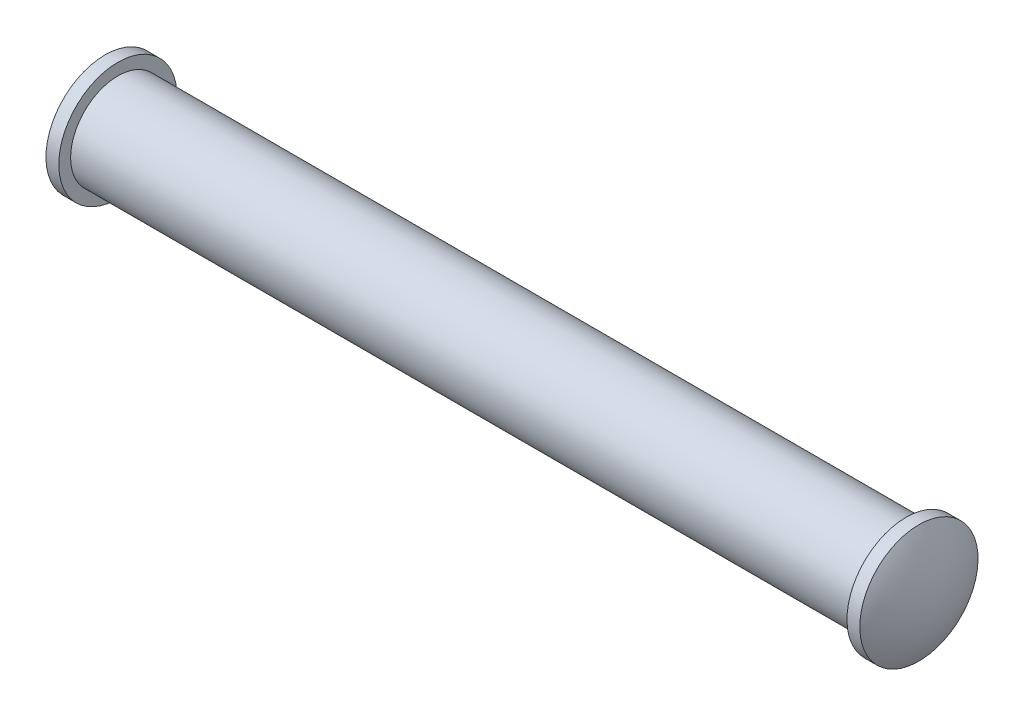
from build123d import *

# Parameters (mm, degrees)
SKETCH1_R           = 4.572
BOSS_EXTRUDE1_DEPTH = 76.2


with BuildPart() as part:
    # Sketch1 → Boss-Extrude1 (new body)
    with BuildSketch(Plane(origin=(0, 0, 0), x_dir=(0, 0, -1), z_dir=(1, 0, 0))):
        with Locations(Location((0, 0, 0), (0, 0, 180))):
            Circle(SKETCH1_R)
    extrude(amount=BOSS_EXTRUDE1_DEPTH)

    # Sketch4 → Revolve1 (revolve)
    with BuildSketch(Plane.XY, mode=Mode.PRIVATE) as revolve1_sk:
        with BuildLine():
            Line((-1.2397581, -5.715), (0, -5.715))
            Line((0, -5.715), (0, 0))
            Line((0, 0), (-2.811501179, 0))
            ThreePointArc((-2.811501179, 0), (-2.411403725, -2.963595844), (-1.2397581, -5.715))
        make_face()
    revolve1 = revolve(revolve1_sk.sketch.rotate(Axis((0, 0, 0), (-1, 0, 0)), 180), axis=Axis((0, 0, 0), (-1, 0, 0)))

    # Mirror1: Revolve1 across plane
    add(revolve1.mirror(Plane(origin=(38.1, 0, 0), x_dir=(0, 0, 1), z_dir=(1, 0, 0))))


solid = part.part
